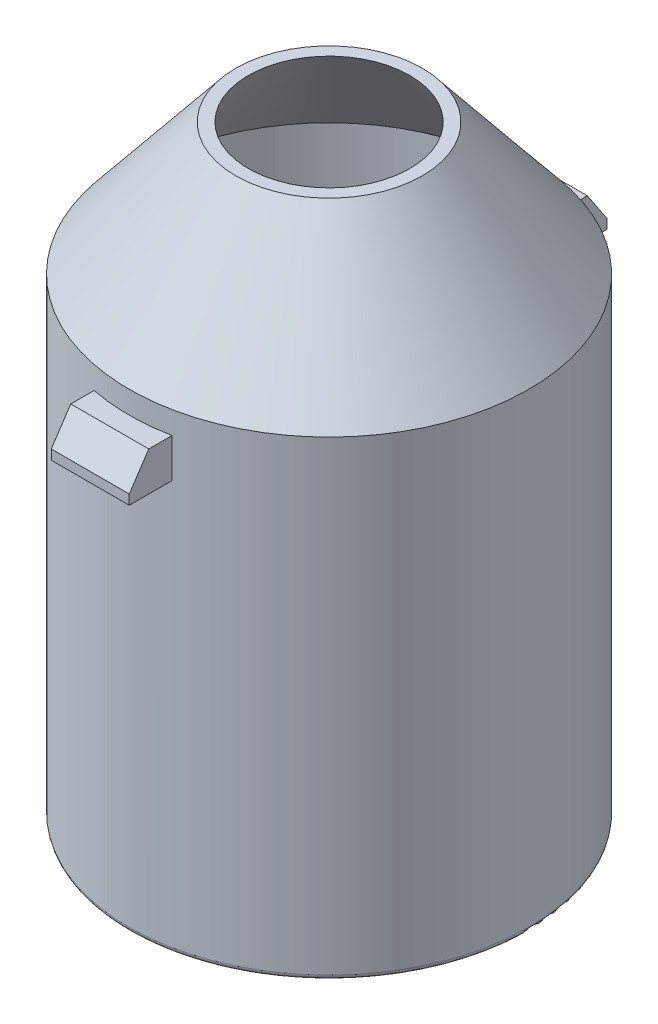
ISO-10303-21;
HEADER;
FILE_DESCRIPTION(('STEP AP214'),'2;1');
FILE_NAME('part.step','',(''),(''),'','','');
FILE_SCHEMA(('AUTOMOTIVE_DESIGN { 1 0 10303 214 1 1 1 1 }'));
ENDSEC;
DATA;
#1=APPLICATION_CONTEXT('core data for automotive mechanical design processes');
#2=APPLICATION_PROTOCOL_DEFINITION('international standard','automotive_design',2000,#1);
#3=PRODUCT_CONTEXT('',#1,'mechanical');
#4=PRODUCT('Part','Part','',(#3));
#5=PRODUCT_RELATED_PRODUCT_CATEGORY('part','',(#4));
#6=PRODUCT_DEFINITION_FORMATION('','',#4);
#7=PRODUCT_DEFINITION_CONTEXT('part definition',#1,'design');
#8=PRODUCT_DEFINITION('design','',#6,#7);
#9=PRODUCT_DEFINITION_SHAPE('','',#8);
#10=(LENGTH_UNIT() NAMED_UNIT(*) SI_UNIT(.MILLI.,.METRE.));
#11=(NAMED_UNIT(*) PLANE_ANGLE_UNIT() SI_UNIT($,.RADIAN.));
#12=(NAMED_UNIT(*) SI_UNIT($,.STERADIAN.) SOLID_ANGLE_UNIT());
#13=UNCERTAINTY_MEASURE_WITH_UNIT(LENGTH_MEASURE(1.E-05),#10,'distance_accuracy_value','');
#14=(GEOMETRIC_REPRESENTATION_CONTEXT(3) GLOBAL_UNCERTAINTY_ASSIGNED_CONTEXT((#13)) GLOBAL_UNIT_ASSIGNED_CONTEXT((#10,
#11,#12)) REPRESENTATION_CONTEXT('',''));
#15=CARTESIAN_POINT('',(0.,0.,0.));
#16=DIRECTION('',(0.,0.,1.));
#17=DIRECTION('',(1.,0.,0.));
#18=AXIS2_PLACEMENT_3D('',#15,#16,#17);
#19=CARTESIAN_POINT('',(0.,75.0275030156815,0.));
#20=DIRECTION('',(0.,-1.,0.));
#21=DIRECTION('',(0.,0.,-1.));
#22=AXIS2_PLACEMENT_3D('',#19,#20,#21);
#23=PLANE('',#22);
#24=CARTESIAN_POINT('',(0.,75.0275030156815,0.));
#25=DIRECTION('',(0.,-1.,0.));
#26=DIRECTION('',(0.,0.,-1.));
#27=AXIS2_PLACEMENT_3D('',#24,#25,#26);
#28=CIRCLE('',#27,1.95);
#29=CARTESIAN_POINT('',(0.,75.0275030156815,-1.95));
#30=VERTEX_POINT('',#29);
#31=EDGE_CURVE('E20',#30,#30,#28,.F.);
#32=ORIENTED_EDGE('',*,*,#31,.T.);
#33=EDGE_LOOP('',(#32));
#34=FACE_BOUND('',#33,.T.);
#35=ADVANCED_FACE('F17',(#34),#23,.F.);
#36=CARTESIAN_POINT('',(0.,79.5275030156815,0.));
#37=DIRECTION('',(0.,-1.,0.));
#38=DIRECTION('',(0.,0.,-1.));
#39=AXIS2_PLACEMENT_3D('',#36,#37,#38);
#40=CYLINDRICAL_SURFACE('',#39,1.95);
#41=CARTESIAN_POINT('',(0.,79.7220911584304,0.));
#42=DIRECTION('',(0.,-1.,0.));
#43=DIRECTION('',(0.,0.,-1.));
#44=AXIS2_PLACEMENT_3D('',#41,#42,#43);
#45=CIRCLE('',#44,1.9500000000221);
#46=CARTESIAN_POINT('',(0.,79.7220911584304,-1.9500000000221));
#47=VERTEX_POINT('',#46);
#48=EDGE_CURVE('E113',#47,#47,#45,.F.);
#49=ORIENTED_EDGE('',*,*,#48,.T.);
#50=EDGE_LOOP('',(#49));
#51=FACE_BOUND('',#50,.T.);
#52=ORIENTED_EDGE('',*,*,#31,.F.);
#53=EDGE_LOOP('',(#52));
#54=FACE_BOUND('',#53,.T.);
#55=ADVANCED_FACE('F157',(#51,#54),#40,.F.);
#56=CARTESIAN_POINT('',(0.,79.7220911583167,0.));
#57=DIRECTION('',(0.,-1.,0.));
#58=DIRECTION('',(0.,0.,-1.));
#59=AXIS2_PLACEMENT_3D('',#56,#57,#58);
#60=CONICAL_SURFACE('',#59,1.95000000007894,0.680678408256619);
#61=ORIENTED_EDGE('',*,*,#48,.F.);
#62=EDGE_LOOP('',(#61));
#63=FACE_BOUND('',#62,.T.);
#64=CARTESIAN_POINT('',(0.,81.1075030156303,0.));
#65=DIRECTION('',(0.,-1.,0.));
#66=DIRECTION('',(0.,0.,-1.));
#67=AXIS2_PLACEMENT_3D('',#64,#65,#66);
#68=CIRCLE('',#67,0.828115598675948);
#69=CARTESIAN_POINT('',(0.,81.1075030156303,-0.828115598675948));
#70=VERTEX_POINT('',#69);
#71=EDGE_CURVE('E103',#70,#70,#68,.F.);
#72=ORIENTED_EDGE('',*,*,#71,.T.);
#73=EDGE_LOOP('',(#72));
#74=FACE_BOUND('',#73,.T.);
#75=ADVANCED_FACE('F154',(#63,#74),#60,.F.);
#76=CARTESIAN_POINT('',(0.,74.9275030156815,0.));
#77=DIRECTION('',(0.,-1.,0.));
#78=DIRECTION('',(0.,0.,-1.));
#79=AXIS2_PLACEMENT_3D('',#76,#77,#78);
#80=PLANE('',#79);
#81=CARTESIAN_POINT('',(0.,74.9275030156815,0.));
#82=DIRECTION('',(0.,1.,0.));
#83=DIRECTION('',(0.,0.,-1.));
#84=AXIS2_PLACEMENT_3D('',#81,#82,#83);
#85=CIRCLE('',#84,2.);
#86=CARTESIAN_POINT('',(0.,74.9275030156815,-2.));
#87=VERTEX_POINT('',#86);
#88=EDGE_CURVE('E110',#87,#87,#85,.T.);
#89=ORIENTED_EDGE('',*,*,#88,.F.);
#90=EDGE_LOOP('',(#89));
#91=FACE_BOUND('',#90,.T.);
#92=ADVANCED_FACE('F143',(#91),#80,.T.);
#93=CARTESIAN_POINT('',(-0.4,79.1275030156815,2.45));
#94=DIRECTION('',(0.,0.,-1.));
#95=DIRECTION('',(-1.,0.,0.));
#96=AXIS2_PLACEMENT_3D('',#93,#94,#95);
#97=PLANE('',#96);
#98=DIRECTION('',(1.,0.,0.));
#99=VECTOR('',#98,1.);
#100=CARTESIAN_POINT('',(-0.4,79.2275030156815,2.45));
#101=LINE('',#100,#99);
#102=CARTESIAN_POINT('',(0.4,79.2275030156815,2.45));
#103=VERTEX_POINT('',#102);
#104=CARTESIAN_POINT('',(-0.4,79.2275030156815,2.45));
#105=VERTEX_POINT('',#104);
#106=EDGE_CURVE('E106',#103,#105,#101,.F.);
#107=ORIENTED_EDGE('',*,*,#106,.T.);
#108=DIRECTION('',(0.,1.,0.));
#109=VECTOR('',#108,1.);
#110=CARTESIAN_POINT('',(-0.4,79.5275030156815,2.45));
#111=LINE('',#110,#109);
#112=CARTESIAN_POINT('',(-0.4,79.1275030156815,2.45));
#113=VERTEX_POINT('',#112);
#114=EDGE_CURVE('E78',#105,#113,#111,.F.);
#115=ORIENTED_EDGE('',*,*,#114,.T.);
#116=DIRECTION('',(1.,0.,0.));
#117=VECTOR('',#116,1.);
#118=CARTESIAN_POINT('',(-0.4,79.1275030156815,2.45));
#119=LINE('',#118,#117);
#120=CARTESIAN_POINT('',(0.4,79.1275030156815,2.45));
#121=VERTEX_POINT('',#120);
#122=EDGE_CURVE('E74',#113,#121,#119,.T.);
#123=ORIENTED_EDGE('',*,*,#122,.T.);
#124=DIRECTION('',(0.,-1.,0.));
#125=VECTOR('',#124,1.);
#126=CARTESIAN_POINT('',(0.4,79.1275030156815,2.45));
#127=LINE('',#126,#125);
#128=EDGE_CURVE('E129',#121,#103,#127,.F.);
#129=ORIENTED_EDGE('',*,*,#128,.T.);
#130=EDGE_LOOP('',(#107,#115,#123,#129));
#131=FACE_BOUND('',#130,.T.);
#132=ADVANCED_FACE('F153',(#131),#97,.F.);
#133=CARTESIAN_POINT('',(-0.4,79.2275030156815,2.45));
#134=DIRECTION('',(0.,-0.554700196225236,-0.832050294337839));
#135=DIRECTION('',(0.,0.832050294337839,-0.554700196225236));
#136=AXIS2_PLACEMENT_3D('',#133,#134,#135);
#137=PLANE('',#136);
#138=DIRECTION('',(1.,0.,0.));
#139=VECTOR('',#138,1.);
#140=CARTESIAN_POINT('',(0.4,79.5275030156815,2.25));
#141=LINE('',#140,#139);
#142=CARTESIAN_POINT('',(0.4,79.5275030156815,2.25));
#143=VERTEX_POINT('',#142);
#144=CARTESIAN_POINT('',(-0.4,79.5275030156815,2.25));
#145=VERTEX_POINT('',#144);
#146=EDGE_CURVE('E256',#143,#145,#141,.F.);
#147=ORIENTED_EDGE('',*,*,#146,.T.);
#148=DIRECTION('',(0.,-0.832050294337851,0.554700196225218));
#149=VECTOR('',#148,1.);
#150=CARTESIAN_POINT('',(-0.4,79.5275030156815,2.25));
#151=LINE('',#150,#149);
#152=EDGE_CURVE('E252',#145,#105,#151,.T.);
#153=ORIENTED_EDGE('',*,*,#152,.T.);
#154=ORIENTED_EDGE('',*,*,#106,.F.);
#155=DIRECTION('',(0.,0.832050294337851,-0.554700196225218));
#156=VECTOR('',#155,1.);
#157=CARTESIAN_POINT('',(0.4,79.2275030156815,2.45));
#158=LINE('',#157,#156);
#159=EDGE_CURVE('E131',#103,#143,#158,.T.);
#160=ORIENTED_EDGE('',*,*,#159,.T.);
#161=EDGE_LOOP('',(#147,#153,#154,#160));
#162=FACE_BOUND('',#161,.T.);
#163=ADVANCED_FACE('F328',(#162),#137,.F.);
#164=CARTESIAN_POINT('',(0.,81.1075030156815,0.));
#165=DIRECTION('',(0.,-1.,0.));
#166=DIRECTION('',(0.,0.,-1.));
#167=AXIS2_PLACEMENT_3D('',#164,#165,#166);
#168=PLANE('',#167);
#169=ORIENTED_EDGE('',*,*,#71,.F.);
#170=EDGE_LOOP('',(#169));
#171=FACE_BOUND('',#170,.T.);
#172=CARTESIAN_POINT('',(0.,81.1075030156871,0.));
#173=DIRECTION('',(0.,-1.,0.));
#174=DIRECTION('',(0.,0.,-1.));
#175=AXIS2_PLACEMENT_3D('',#172,#173,#174);
#176=CIRCLE('',#175,0.956791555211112);
#177=CARTESIAN_POINT('',(0.,81.1075030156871,-0.956791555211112));
#178=VERTEX_POINT('',#177);
#179=EDGE_CURVE('E100',#178,#178,#176,.T.);
#180=ORIENTED_EDGE('',*,*,#179,.F.);
#181=EDGE_LOOP('',(#180));
#182=FACE_BOUND('',#181,.T.);
#183=ADVANCED_FACE('F330',(#171,#182),#168,.F.);
#184=CARTESIAN_POINT('',(-0.4,79.1275030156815,-2.45));
#185=DIRECTION('',(0.,0.,1.));
#186=DIRECTION('',(1.,0.,0.));
#187=AXIS2_PLACEMENT_3D('',#184,#185,#186);
#188=PLANE('',#187);
#189=DIRECTION('',(1.,0.,0.));
#190=VECTOR('',#189,1.);
#191=CARTESIAN_POINT('',(0.4,79.2275030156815,-2.45000000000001));
#192=LINE('',#191,#190);
#193=CARTESIAN_POINT('',(-0.4,79.2275030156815,-2.45));
#194=VERTEX_POINT('',#193);
#195=CARTESIAN_POINT('',(0.4,79.2275030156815,-2.45));
#196=VERTEX_POINT('',#195);
#197=EDGE_CURVE('E105',#194,#196,#192,.T.);
#198=ORIENTED_EDGE('',*,*,#197,.T.);
#199=DIRECTION('',(0.,-1.,0.));
#200=VECTOR('',#199,1.);
#201=CARTESIAN_POINT('',(0.4,79.1275030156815,-2.45));
#202=LINE('',#201,#200);
#203=CARTESIAN_POINT('',(0.4,79.1275030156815,-2.45));
#204=VERTEX_POINT('',#203);
#205=EDGE_CURVE('E221',#196,#204,#202,.T.);
#206=ORIENTED_EDGE('',*,*,#205,.T.);
#207=DIRECTION('',(1.,0.,0.));
#208=VECTOR('',#207,1.);
#209=CARTESIAN_POINT('',(-0.4,79.1275030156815,-2.45));
#210=LINE('',#209,#208);
#211=CARTESIAN_POINT('',(-0.4,79.1275030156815,-2.45));
#212=VERTEX_POINT('',#211);
#213=EDGE_CURVE('E234',#204,#212,#210,.F.);
#214=ORIENTED_EDGE('',*,*,#213,.T.);
#215=DIRECTION('',(0.,1.,0.));
#216=VECTOR('',#215,1.);
#217=CARTESIAN_POINT('',(-0.4,79.5275030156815,-2.45));
#218=LINE('',#217,#216);
#219=EDGE_CURVE('E102',#212,#194,#218,.T.);
#220=ORIENTED_EDGE('',*,*,#219,.T.);
#221=EDGE_LOOP('',(#198,#206,#214,#220));
#222=FACE_BOUND('',#221,.T.);
#223=ADVANCED_FACE('F335',(#222),#188,.F.);
#224=CARTESIAN_POINT('',(0.4,79.5275030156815,-2.25));
#225=DIRECTION('',(0.,-0.554700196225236,0.832050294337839));
#226=DIRECTION('',(0.,-0.832050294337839,-0.554700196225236));
#227=AXIS2_PLACEMENT_3D('',#224,#225,#226);
#228=PLANE('',#227);
#229=ORIENTED_EDGE('',*,*,#197,.F.);
#230=DIRECTION('',(0.,0.832050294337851,0.554700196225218));
#231=VECTOR('',#230,1.);
#232=CARTESIAN_POINT('',(-0.4,79.2275030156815,-2.45));
#233=LINE('',#232,#231);
#234=CARTESIAN_POINT('',(-0.4,79.5275030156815,-2.25));
#235=VERTEX_POINT('',#234);
#236=EDGE_CURVE('E231',#194,#235,#233,.T.);
#237=ORIENTED_EDGE('',*,*,#236,.T.);
#238=DIRECTION('',(1.,0.,0.));
#239=VECTOR('',#238,1.);
#240=CARTESIAN_POINT('',(0.4,79.5275030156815,-2.25));
#241=LINE('',#240,#239);
#242=CARTESIAN_POINT('',(0.4,79.5275030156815,-2.25));
#243=VERTEX_POINT('',#242);
#244=EDGE_CURVE('E225',#235,#243,#241,.T.);
#245=ORIENTED_EDGE('',*,*,#244,.T.);
#246=DIRECTION('',(0.,-0.832050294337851,-0.554700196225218));
#247=VECTOR('',#246,1.);
#248=CARTESIAN_POINT('',(0.4,79.5275030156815,-2.25));
#249=LINE('',#248,#247);
#250=EDGE_CURVE('E218',#243,#196,#249,.T.);
#251=ORIENTED_EDGE('',*,*,#250,.T.);
#252=EDGE_LOOP('',(#229,#237,#245,#251));
#253=FACE_BOUND('',#252,.T.);
#254=ADVANCED_FACE('F210',(#253),#228,.F.);
#255=CARTESIAN_POINT('',(0.,74.9775030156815,0.));
#256=DIRECTION('',(0.,-1.,0.));
#257=DIRECTION('',(0.,0.,1.));
#258=AXIS2_PLACEMENT_3D('',#255,#256,#257);
#259=TOROIDAL_SURFACE('',#258,2.,0.05);
#260=ORIENTED_EDGE('',*,*,#88,.T.);
#261=EDGE_LOOP('',(#260));
#262=FACE_BOUND('',#261,.T.);
#263=CARTESIAN_POINT('',(0.,74.9775030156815,0.));
#264=DIRECTION('',(0.,-1.,0.));
#265=DIRECTION('',(0.,0.,-1.));
#266=AXIS2_PLACEMENT_3D('',#263,#264,#265);
#267=CIRCLE('',#266,2.05);
#268=CARTESIAN_POINT('',(0.,74.9775030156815,-2.05));
#269=VERTEX_POINT('',#268);
#270=EDGE_CURVE('E95',#269,#269,#267,.F.);
#271=ORIENTED_EDGE('',*,*,#270,.F.);
#272=EDGE_LOOP('',(#271));
#273=FACE_BOUND('',#272,.T.);
#274=ADVANCED_FACE('F205',(#262,#273),#259,.T.);
#275=CARTESIAN_POINT('',(0.4,79.1275030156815,2.45));
#276=DIRECTION('',(-1.,0.,0.));
#277=DIRECTION('',(0.,-1.,0.));
#278=AXIS2_PLACEMENT_3D('',#275,#276,#277);
#279=PLANE('',#278);
#280=DIRECTION('',(0.,0.,-1.));
#281=VECTOR('',#280,1.);
#282=CARTESIAN_POINT('',(0.4,79.5275030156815,2.45));
#283=LINE('',#282,#281);
#284=CARTESIAN_POINT('',(0.4,79.5275030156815,2.01059692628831));
#285=VERTEX_POINT('',#284);
#286=EDGE_CURVE('E77',#285,#143,#283,.F.);
#287=ORIENTED_EDGE('',*,*,#286,.T.);
#288=ORIENTED_EDGE('',*,*,#159,.F.);
#289=ORIENTED_EDGE('',*,*,#128,.F.);
#290=DIRECTION('',(0.,0.,1.));
#291=VECTOR('',#290,1.);
#292=CARTESIAN_POINT('',(0.4,79.1275030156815,2.45));
#293=LINE('',#292,#291);
#294=CARTESIAN_POINT('',(0.4,79.1275030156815,2.01059692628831));
#295=VERTEX_POINT('',#294);
#296=EDGE_CURVE('E60',#121,#295,#293,.F.);
#297=ORIENTED_EDGE('',*,*,#296,.T.);
#298=DIRECTION('',(0.,-1.,0.));
#299=VECTOR('',#298,1.);
#300=CARTESIAN_POINT('',(0.4,79.5275030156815,2.01059692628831));
#301=LINE('',#300,#299);
#302=EDGE_CURVE('E93',#285,#295,#301,.T.);
#303=ORIENTED_EDGE('',*,*,#302,.F.);
#304=EDGE_LOOP('',(#287,#288,#289,#297,#303));
#305=FACE_BOUND('',#304,.T.);
#306=ADVANCED_FACE('F202',(#305),#279,.F.);
#307=CARTESIAN_POINT('',(-0.4,79.1275030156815,2.45));
#308=DIRECTION('',(0.,1.,0.));
#309=DIRECTION('',(0.,0.,1.));
#310=AXIS2_PLACEMENT_3D('',#307,#308,#309);
#311=PLANE('',#310);
#312=ORIENTED_EDGE('',*,*,#296,.F.);
#313=ORIENTED_EDGE('',*,*,#122,.F.);
#314=DIRECTION('',(0.,0.,-1.));
#315=VECTOR('',#314,1.);
#316=CARTESIAN_POINT('',(-0.4,79.1275030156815,2.45));
#317=LINE('',#316,#315);
#318=CARTESIAN_POINT('',(-0.4,79.1275030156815,2.01059692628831));
#319=VERTEX_POINT('',#318);
#320=EDGE_CURVE('E66',#113,#319,#317,.T.);
#321=ORIENTED_EDGE('',*,*,#320,.T.);
#322=CARTESIAN_POINT('',(0.,79.1275030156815,0.));
#323=DIRECTION('',(0.,-1.,0.));
#324=DIRECTION('',(0.,0.,-1.));
#325=AXIS2_PLACEMENT_3D('',#322,#323,#324);
#326=CIRCLE('',#325,2.05);
#327=EDGE_CURVE('E70',#295,#319,#326,.T.);
#328=ORIENTED_EDGE('',*,*,#327,.F.);
#329=EDGE_LOOP('',(#312,#313,#321,#328));
#330=FACE_BOUND('',#329,.T.);
#331=ADVANCED_FACE('F68',(#330),#311,.F.);
#332=CARTESIAN_POINT('',(-0.4,79.5275030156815,2.45));
#333=DIRECTION('',(1.,0.,0.));
#334=DIRECTION('',(0.,0.,-1.));
#335=AXIS2_PLACEMENT_3D('',#332,#333,#334);
#336=PLANE('',#335);
#337=ORIENTED_EDGE('',*,*,#320,.F.);
#338=ORIENTED_EDGE('',*,*,#114,.F.);
#339=ORIENTED_EDGE('',*,*,#152,.F.);
#340=DIRECTION('',(0.,0.,-1.));
#341=VECTOR('',#340,1.);
#342=CARTESIAN_POINT('',(-0.4,79.5275030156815,2.45));
#343=LINE('',#342,#341);
#344=CARTESIAN_POINT('',(-0.4,79.5275030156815,2.01059692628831));
#345=VERTEX_POINT('',#344);
#346=EDGE_CURVE('E85',#145,#345,#343,.T.);
#347=ORIENTED_EDGE('',*,*,#346,.T.);
#348=DIRECTION('',(0.,-1.,0.));
#349=VECTOR('',#348,1.);
#350=CARTESIAN_POINT('',(-0.4,79.5275030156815,2.01059692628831));
#351=LINE('',#350,#349);
#352=EDGE_CURVE('E81',#319,#345,#351,.F.);
#353=ORIENTED_EDGE('',*,*,#352,.F.);
#354=EDGE_LOOP('',(#337,#338,#339,#347,#353));
#355=FACE_BOUND('',#354,.T.);
#356=ADVANCED_FACE('F82',(#355),#336,.F.);
#357=CARTESIAN_POINT('',(0.4,79.5275030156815,2.45));
#358=DIRECTION('',(0.,-1.,0.));
#359=DIRECTION('',(0.,0.,-1.));
#360=AXIS2_PLACEMENT_3D('',#357,#358,#359);
#361=PLANE('',#360);
#362=ORIENTED_EDGE('',*,*,#346,.F.);
#363=ORIENTED_EDGE('',*,*,#146,.F.);
#364=ORIENTED_EDGE('',*,*,#286,.F.);
#365=CARTESIAN_POINT('',(0.,79.5275030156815,0.));
#366=DIRECTION('',(0.,-1.,0.));
#367=DIRECTION('',(0.,0.,-1.));
#368=AXIS2_PLACEMENT_3D('',#365,#366,#367);
#369=CIRCLE('',#368,2.05);
#370=EDGE_CURVE('E89',#345,#285,#369,.F.);
#371=ORIENTED_EDGE('',*,*,#370,.F.);
#372=EDGE_LOOP('',(#362,#363,#364,#371));
#373=FACE_BOUND('',#372,.T.);
#374=ADVANCED_FACE('F193',(#373),#361,.F.);
#375=CARTESIAN_POINT('',(0.,79.7575030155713,0.));
#376=DIRECTION('',(0.,-1.,0.));
#377=DIRECTION('',(0.,0.,-1.));
#378=AXIS2_PLACEMENT_3D('',#375,#376,#377);
#379=CONICAL_SURFACE('',#378,2.05000000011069,0.680678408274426);
#380=CARTESIAN_POINT('',(0.,79.7575030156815,0.));
#381=DIRECTION('',(0.,-1.,0.));
#382=DIRECTION('',(0.,0.,-1.));
#383=AXIS2_PLACEMENT_3D('',#380,#381,#382);
#384=CIRCLE('',#383,2.05);
#385=CARTESIAN_POINT('',(0.,79.7575030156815,-2.05));
#386=VERTEX_POINT('',#385);
#387=EDGE_CURVE('E309',#386,#386,#384,.T.);
#388=ORIENTED_EDGE('',*,*,#387,.F.);
#389=EDGE_LOOP('',(#388));
#390=FACE_BOUND('',#389,.T.);
#391=ORIENTED_EDGE('',*,*,#179,.T.);
#392=EDGE_LOOP('',(#391));
#393=FACE_BOUND('',#392,.T.);
#394=ADVANCED_FACE('F189',(#390,#393),#379,.T.);
#395=CARTESIAN_POINT('',(-0.4,79.5275030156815,-2.45));
#396=DIRECTION('',(1.,0.,0.));
#397=DIRECTION('',(0.,0.,-1.));
#398=AXIS2_PLACEMENT_3D('',#395,#396,#397);
#399=PLANE('',#398);
#400=DIRECTION('',(0.,0.,-1.));
#401=VECTOR('',#400,1.);
#402=CARTESIAN_POINT('',(-0.4,79.5275030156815,-2.45));
#403=LINE('',#402,#401);
#404=CARTESIAN_POINT('',(-0.4,79.5275030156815,-2.01059692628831));
#405=VERTEX_POINT('',#404);
#406=EDGE_CURVE('E228',#405,#235,#403,.T.);
#407=ORIENTED_EDGE('',*,*,#406,.T.);
#408=ORIENTED_EDGE('',*,*,#236,.F.);
#409=ORIENTED_EDGE('',*,*,#219,.F.);
#410=DIRECTION('',(0.,0.,1.));
#411=VECTOR('',#410,1.);
#412=CARTESIAN_POINT('',(-0.4,79.1275030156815,-2.45));
#413=LINE('',#412,#411);
#414=CARTESIAN_POINT('',(-0.4,79.1275030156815,-2.01059692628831));
#415=VERTEX_POINT('',#414);
#416=EDGE_CURVE('E222',#212,#415,#413,.T.);
#417=ORIENTED_EDGE('',*,*,#416,.T.);
#418=DIRECTION('',(0.,-1.,0.));
#419=VECTOR('',#418,1.);
#420=CARTESIAN_POINT('',(-0.400000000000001,79.5275030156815,-2.01059692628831));
#421=LINE('',#420,#419);
#422=EDGE_CURVE('E306',#405,#415,#421,.T.);
#423=ORIENTED_EDGE('',*,*,#422,.F.);
#424=EDGE_LOOP('',(#407,#408,#409,#417,#423));
#425=FACE_BOUND('',#424,.T.);
#426=ADVANCED_FACE('F185',(#425),#399,.F.);
#427=CARTESIAN_POINT('',(-0.4,79.1275030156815,-2.45));
#428=DIRECTION('',(0.,1.,0.));
#429=DIRECTION('',(0.,0.,1.));
#430=AXIS2_PLACEMENT_3D('',#427,#428,#429);
#431=PLANE('',#430);
#432=ORIENTED_EDGE('',*,*,#416,.F.);
#433=ORIENTED_EDGE('',*,*,#213,.F.);
#434=DIRECTION('',(0.,0.,1.));
#435=VECTOR('',#434,1.);
#436=CARTESIAN_POINT('',(0.4,79.1275030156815,-2.45));
#437=LINE('',#436,#435);
#438=CARTESIAN_POINT('',(0.4,79.1275030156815,-2.01059692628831));
#439=VERTEX_POINT('',#438);
#440=EDGE_CURVE('E243',#204,#439,#437,.T.);
#441=ORIENTED_EDGE('',*,*,#440,.T.);
#442=CARTESIAN_POINT('',(0.,79.1275030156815,0.));
#443=DIRECTION('',(0.,-1.,0.));
#444=DIRECTION('',(0.,0.,-1.));
#445=AXIS2_PLACEMENT_3D('',#442,#443,#444);
#446=CIRCLE('',#445,2.05);
#447=EDGE_CURVE('E305',#415,#439,#446,.T.);
#448=ORIENTED_EDGE('',*,*,#447,.F.);
#449=EDGE_LOOP('',(#432,#433,#441,#448));
#450=FACE_BOUND('',#449,.T.);
#451=ADVANCED_FACE('F182',(#450),#431,.F.);
#452=CARTESIAN_POINT('',(0.4,79.1275030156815,-2.45));
#453=DIRECTION('',(-1.,0.,0.));
#454=DIRECTION('',(0.,-1.,0.));
#455=AXIS2_PLACEMENT_3D('',#452,#453,#454);
#456=PLANE('',#455);
#457=ORIENTED_EDGE('',*,*,#440,.F.);
#458=ORIENTED_EDGE('',*,*,#205,.F.);
#459=ORIENTED_EDGE('',*,*,#250,.F.);
#460=DIRECTION('',(0.,0.,-1.));
#461=VECTOR('',#460,1.);
#462=CARTESIAN_POINT('',(0.4,79.5275030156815,-2.45));
#463=LINE('',#462,#461);
#464=CARTESIAN_POINT('',(0.4,79.5275030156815,-2.01059692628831));
#465=VERTEX_POINT('',#464);
#466=EDGE_CURVE('E35',#243,#465,#463,.F.);
#467=ORIENTED_EDGE('',*,*,#466,.T.);
#468=DIRECTION('',(0.,-1.,0.));
#469=VECTOR('',#468,1.);
#470=CARTESIAN_POINT('',(0.4,79.5275030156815,-2.01059692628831));
#471=LINE('',#470,#469);
#472=EDGE_CURVE('E26',#439,#465,#471,.F.);
#473=ORIENTED_EDGE('',*,*,#472,.F.);
#474=EDGE_LOOP('',(#457,#458,#459,#467,#473));
#475=FACE_BOUND('',#474,.T.);
#476=ADVANCED_FACE('F174',(#475),#456,.F.);
#477=CARTESIAN_POINT('',(0.4,79.5275030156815,-2.45));
#478=DIRECTION('',(0.,-1.,0.));
#479=DIRECTION('',(0.,0.,-1.));
#480=AXIS2_PLACEMENT_3D('',#477,#478,#479);
#481=PLANE('',#480);
#482=ORIENTED_EDGE('',*,*,#466,.F.);
#483=ORIENTED_EDGE('',*,*,#244,.F.);
#484=ORIENTED_EDGE('',*,*,#406,.F.);
#485=CARTESIAN_POINT('',(0.,79.5275030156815,0.));
#486=DIRECTION('',(0.,-1.,0.));
#487=DIRECTION('',(0.,0.,-1.));
#488=AXIS2_PLACEMENT_3D('',#485,#486,#487);
#489=CIRCLE('',#488,2.05);
#490=EDGE_CURVE('E11',#465,#405,#489,.F.);
#491=ORIENTED_EDGE('',*,*,#490,.F.);
#492=EDGE_LOOP('',(#482,#483,#484,#491));
#493=FACE_BOUND('',#492,.T.);
#494=ADVANCED_FACE('F168',(#493),#481,.F.);
#495=CARTESIAN_POINT('',(0.,79.5275030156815,0.));
#496=DIRECTION('',(0.,-1.,0.));
#497=DIRECTION('',(0.,0.,-1.));
#498=AXIS2_PLACEMENT_3D('',#495,#496,#497);
#499=CYLINDRICAL_SURFACE('',#498,2.05);
#500=ORIENTED_EDGE('',*,*,#472,.T.);
#501=ORIENTED_EDGE('',*,*,#490,.T.);
#502=ORIENTED_EDGE('',*,*,#422,.T.);
#503=ORIENTED_EDGE('',*,*,#447,.T.);
#504=EDGE_LOOP('',(#500,#501,#502,#503));
#505=FACE_BOUND('',#504,.T.);
#506=ORIENTED_EDGE('',*,*,#387,.T.);
#507=EDGE_LOOP('',(#506));
#508=FACE_BOUND('',#507,.T.);
#509=ORIENTED_EDGE('',*,*,#352,.T.);
#510=ORIENTED_EDGE('',*,*,#370,.T.);
#511=ORIENTED_EDGE('',*,*,#302,.T.);
#512=ORIENTED_EDGE('',*,*,#327,.T.);
#513=EDGE_LOOP('',(#509,#510,#511,#512));
#514=FACE_BOUND('',#513,.T.);
#515=ORIENTED_EDGE('',*,*,#270,.T.);
#516=EDGE_LOOP('',(#515));
#517=FACE_BOUND('',#516,.T.);
#518=ADVANCED_FACE('F91',(#505,#508,#514,#517),#499,.T.);
#519=CLOSED_SHELL('',(#35,#55,#75,#92,#132,#163,#183,#223,#254,#274,#306,#331,#356,#374,#394,
#426,#451,#476,#494,#518));
#520=MANIFOLD_SOLID_BREP('B1',#519);
#521=ADVANCED_BREP_SHAPE_REPRESENTATION('',(#18,#520),#14);
#522=SHAPE_DEFINITION_REPRESENTATION(#9,#521);
ENDSEC;
END-ISO-10303-21;
